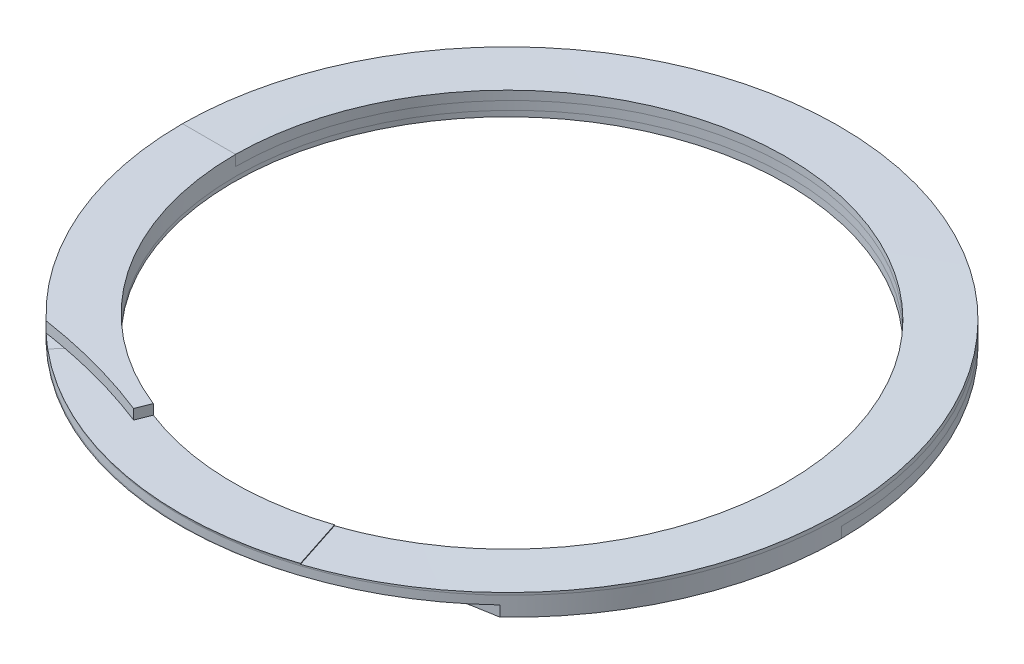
ISO-10303-21;
HEADER;
FILE_DESCRIPTION(('STEP AP214'),'2;1');
FILE_NAME('part.step','',(''),(''),'','','');
FILE_SCHEMA(('AUTOMOTIVE_DESIGN { 1 0 10303 214 1 1 1 1 }'));
ENDSEC;
DATA;
#1=APPLICATION_CONTEXT('core data for automotive mechanical design processes');
#2=APPLICATION_PROTOCOL_DEFINITION('international standard','automotive_design',2000,#1);
#3=PRODUCT_CONTEXT('',#1,'mechanical');
#4=PRODUCT('Part','Part','',(#3));
#5=PRODUCT_RELATED_PRODUCT_CATEGORY('part','',(#4));
#6=PRODUCT_DEFINITION_FORMATION('','',#4);
#7=PRODUCT_DEFINITION_CONTEXT('part definition',#1,'design');
#8=PRODUCT_DEFINITION('design','',#6,#7);
#9=PRODUCT_DEFINITION_SHAPE('','',#8);
#10=(LENGTH_UNIT() NAMED_UNIT(*) SI_UNIT(.MILLI.,.METRE.));
#11=(NAMED_UNIT(*) PLANE_ANGLE_UNIT() SI_UNIT($,.RADIAN.));
#12=(NAMED_UNIT(*) SI_UNIT($,.STERADIAN.) SOLID_ANGLE_UNIT());
#13=UNCERTAINTY_MEASURE_WITH_UNIT(LENGTH_MEASURE(1.E-05),#10,'distance_accuracy_value','');
#14=(GEOMETRIC_REPRESENTATION_CONTEXT(3) GLOBAL_UNCERTAINTY_ASSIGNED_CONTEXT((#13)) GLOBAL_UNIT_ASSIGNED_CONTEXT((#10,
#11,#12)) REPRESENTATION_CONTEXT('',''));
#15=CARTESIAN_POINT('',(0.,0.,0.));
#16=DIRECTION('',(0.,0.,1.));
#17=DIRECTION('',(1.,0.,0.));
#18=AXIS2_PLACEMENT_3D('',#15,#16,#17);
#19=CARTESIAN_POINT('',(0.,-1.0668,0.));
#20=DIRECTION('',(0.,1.,0.));
#21=DIRECTION('',(0.,0.,1.));
#22=AXIS2_PLACEMENT_3D('',#19,#20,#21);
#23=CYLINDRICAL_SURFACE('',#22,9.9187);
#24=CARTESIAN_POINT('',(0.,-0.6858,0.));
#25=DIRECTION('',(0.,1.,0.));
#26=DIRECTION('',(0.,0.,1.));
#27=AXIS2_PLACEMENT_3D('',#24,#25,#26);
#28=CIRCLE('',#27,9.9187);
#29=CARTESIAN_POINT('',(3.06504244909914,-0.685442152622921,9.43324570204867));
#30=VERTEX_POINT('',#29);
#31=CARTESIAN_POINT('',(3.64850153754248,-0.6858,9.22328825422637));
#32=VERTEX_POINT('',#31);
#33=EDGE_CURVE('E208',#30,#32,#28,.T.);
#34=ORIENTED_EDGE('',*,*,#33,.F.);
#35=CARTESIAN_POINT('',(9.9187,-1.0668,0.));
#36=CARTESIAN_POINT('',(9.9187,-1.0271125,-5.72656411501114));
#37=CARTESIAN_POINT('',(4.95935,-0.987425,-8.58984617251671));
#38=CARTESIAN_POINT('',(0.,-0.9477375,-11.4531282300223));
#39=CARTESIAN_POINT('',(-4.95935,-0.90805,-8.58984617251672));
#40=CARTESIAN_POINT('',(-9.9187,-0.8683625,-5.72656411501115));
#41=CARTESIAN_POINT('',(-9.9187,-0.828675,0.));
#42=CARTESIAN_POINT('',(-9.9187,-0.7889875,5.72656411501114));
#43=CARTESIAN_POINT('',(-4.95935000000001,-0.7493,8.58984617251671));
#44=CARTESIAN_POINT('',(-1.13490607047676,-0.718694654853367,10.7978899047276));
#45=CARTESIAN_POINT('',(3.06504321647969,-0.685084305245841,9.43324545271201));
#46=CARTESIAN_POINT('',(3.3015381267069,-0.683191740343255,9.35640369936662));
#47=CARTESIAN_POINT('',(3.53803303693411,-0.681299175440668,9.27956194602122));
#48=(BOUNDED_CURVE() B_SPLINE_CURVE(2,(#35,#36,#37,#38,#39,#40,#41,#42,#43,#44,#45,#46,#47),
.UNSPECIFIED.,.F.,.F.) B_SPLINE_CURVE_WITH_KNOTS((3,2,2,2,2,2,3),(0.,0.166666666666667,
0.333333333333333,0.5,0.666666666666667,0.799258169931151,0.807250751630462),
.UNSPECIFIED.) CURVE() GEOMETRIC_REPRESENTATION_ITEM() RATIONAL_B_SPLINE_CURVE((1.,
0.866025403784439,1.,0.866025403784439,1.,0.866025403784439,1.,0.866025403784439,1.,
0.893416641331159,0.95641785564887,0.95641785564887,0.95641785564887)) REPRESENTATION_ITEM(''));
#49=CARTESIAN_POINT('',(2.97561000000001,-0.6858,9.46183675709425));
#50=VERTEX_POINT('',#49);
#51=EDGE_CURVE('E290',#50,#30,#48,.T.);
#52=ORIENTED_EDGE('',*,*,#51,.F.);
#53=CARTESIAN_POINT('',(9.9187,-0.6858,0.));
#54=VERTEX_POINT('',#53);
#55=EDGE_CURVE('E53',#54,#50,#28,.T.);
#56=ORIENTED_EDGE('',*,*,#55,.F.);
#57=DIRECTION('',(0.,-1.,0.));
#58=VECTOR('',#57,1.);
#59=CARTESIAN_POINT('',(9.9187,-0.6858,0.));
#60=LINE('',#59,#58);
#61=CARTESIAN_POINT('',(9.9187,-1.0668,0.));
#62=VERTEX_POINT('',#61);
#63=EDGE_CURVE('E178',#54,#62,#60,.T.);
#64=ORIENTED_EDGE('',*,*,#63,.T.);
#65=CARTESIAN_POINT('',(0.,-1.0668,0.));
#66=DIRECTION('',(0.,1.,0.));
#67=DIRECTION('',(0.,0.,1.));
#68=AXIS2_PLACEMENT_3D('',#65,#66,#67);
#69=CIRCLE('',#68,9.9187);
#70=CARTESIAN_POINT('',(3.64850153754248,-1.0668,9.22328825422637));
#71=VERTEX_POINT('',#70);
#72=EDGE_CURVE('E507',#71,#62,#69,.T.);
#73=ORIENTED_EDGE('',*,*,#72,.F.);
#74=DIRECTION('',(0.,-1.,0.));
#75=VECTOR('',#74,1.);
#76=CARTESIAN_POINT('',(3.64850153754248,-0.6858,9.22328825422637));
#77=LINE('',#76,#75);
#78=EDGE_CURVE('E186',#32,#71,#77,.T.);
#79=ORIENTED_EDGE('',*,*,#78,.F.);
#80=EDGE_LOOP('',(#34,#52,#56,#64,#73,#79));
#81=FACE_BOUND('',#80,.T.);
#82=CARTESIAN_POINT('',(3.53803152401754,-0.328874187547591,9.2795625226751));
#83=CARTESIAN_POINT('',(3.30153660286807,-0.330766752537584,9.35640423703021));
#84=CARTESIAN_POINT('',(3.06504168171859,-0.332659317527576,9.43324595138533));
#85=CARTESIAN_POINT('',(-1.13490690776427,-0.366269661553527,10.7978894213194));
#86=CARTESIAN_POINT('',(-4.95935000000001,-0.396874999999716,8.58984617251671));
#87=CARTESIAN_POINT('',(-9.9187,-0.436562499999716,5.72656411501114));
#88=CARTESIAN_POINT('',(-9.9187,-0.476249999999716,0.));
#89=CARTESIAN_POINT('',(-9.9187,-0.515937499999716,-5.72656411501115));
#90=CARTESIAN_POINT('',(-4.95935,-0.555624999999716,-8.58984617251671));
#91=CARTESIAN_POINT('',(0.,-0.595312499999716,-11.4531282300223));
#92=CARTESIAN_POINT('',(4.95935,-0.634999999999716,-8.58984617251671));
#93=CARTESIAN_POINT('',(9.9187,-0.674687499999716,-5.72656411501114));
#94=CARTESIAN_POINT('',(9.9187,-0.714374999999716,0.));
#95=(BOUNDED_CURVE() B_SPLINE_CURVE(2,(#82,#83,#84,#85,#86,#87,#88,#89,#90,#91,#92,#93,#94),
.UNSPECIFIED.,.F.,.F.) B_SPLINE_CURVE_WITH_KNOTS((3,2,2,2,2,2,3),(0.,0.00799258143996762,
0.140584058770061,0.307250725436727,0.473917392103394,0.640584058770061,0.807250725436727),
.UNSPECIFIED.) CURVE() GEOMETRIC_REPRESENTATION_ITEM() RATIONAL_B_SPLINE_CURVE((0.956417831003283,
0.956417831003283,0.956417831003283,0.893416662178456,1.,0.866025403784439,1.,0.866025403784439,
1.,0.866025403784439,1.,0.866025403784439,1.)) REPRESENTATION_ITEM(''));
#96=CARTESIAN_POINT('',(-2.97561,-0.381,9.46183675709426));
#97=VERTEX_POINT('',#96);
#98=CARTESIAN_POINT('',(-3.06504321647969,-0.381536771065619,9.43324545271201));
#99=VERTEX_POINT('',#98);
#100=EDGE_CURVE('E218',#97,#99,#95,.T.);
#101=ORIENTED_EDGE('',*,*,#100,.F.);
#102=CARTESIAN_POINT('',(0.,-0.381,0.));
#103=DIRECTION('',(0.,-1.,0.));
#104=DIRECTION('',(0.,0.,1.));
#105=AXIS2_PLACEMENT_3D('',#102,#103,#104);
#106=CIRCLE('',#105,9.9187);
#107=CARTESIAN_POINT('',(-9.9187,-0.381,0.));
#108=VERTEX_POINT('',#107);
#109=EDGE_CURVE('E249',#108,#97,#106,.T.);
#110=ORIENTED_EDGE('',*,*,#109,.F.);
#111=DIRECTION('',(0.,1.,0.));
#112=VECTOR('',#111,1.);
#113=CARTESIAN_POINT('',(-9.9187,-0.381,0.));
#114=LINE('',#113,#112);
#115=CARTESIAN_POINT('',(-9.9187,0.,0.));
#116=VERTEX_POINT('',#115);
#117=EDGE_CURVE('E512',#108,#116,#114,.T.);
#118=ORIENTED_EDGE('',*,*,#117,.T.);
#119=CARTESIAN_POINT('',(0.,0.,0.));
#120=DIRECTION('',(0.,1.,0.));
#121=DIRECTION('',(0.,0.,1.));
#122=AXIS2_PLACEMENT_3D('',#119,#120,#121);
#123=CIRCLE('',#122,9.9187);
#124=CARTESIAN_POINT('',(-3.64850153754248,0.,9.22328825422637));
#125=VERTEX_POINT('',#124);
#126=EDGE_CURVE('E508',#116,#125,#123,.T.);
#127=ORIENTED_EDGE('',*,*,#126,.T.);
#128=DIRECTION('',(0.,1.,0.));
#129=VECTOR('',#128,1.);
#130=CARTESIAN_POINT('',(-3.64850153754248,-0.381,9.22328825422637));
#131=LINE('',#130,#129);
#132=CARTESIAN_POINT('',(-3.64850153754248,-0.357809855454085,9.22328825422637));
#133=VERTEX_POINT('',#132);
#134=EDGE_CURVE('E518',#133,#125,#131,.T.);
#135=ORIENTED_EDGE('',*,*,#134,.F.);
#136=CARTESIAN_POINT('',(-3.64850153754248,-0.381,9.22328825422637));
#137=VERTEX_POINT('',#136);
#138=EDGE_CURVE('E515',#137,#133,#131,.T.);
#139=ORIENTED_EDGE('',*,*,#138,.F.);
#140=EDGE_CURVE('E245',#99,#137,#106,.T.);
#141=ORIENTED_EDGE('',*,*,#140,.F.);
#142=EDGE_LOOP('',(#101,#110,#118,#127,#135,#139,#141));
#143=FACE_BOUND('',#142,.T.);
#144=ADVANCED_FACE('F48',(#81,#143),#23,.F.);
#145=CARTESIAN_POINT('',(0.,-1.0668,0.));
#146=DIRECTION('',(0.,1.,0.));
#147=DIRECTION('',(0.,0.,1.));
#148=AXIS2_PLACEMENT_3D('',#145,#146,#147);
#149=CYLINDRICAL_SURFACE('',#148,11.8237);
#150=DIRECTION('',(0.,1.,0.));
#151=VECTOR('',#150,1.);
#152=CARTESIAN_POINT('',(-11.8237,-0.381,0.));
#153=LINE('',#152,#151);
#154=CARTESIAN_POINT('',(-11.8237,-0.381,0.));
#155=VERTEX_POINT('',#154);
#156=CARTESIAN_POINT('',(-11.8237,0.,0.));
#157=VERTEX_POINT('',#156);
#158=EDGE_CURVE('E523',#155,#157,#153,.T.);
#159=ORIENTED_EDGE('',*,*,#158,.F.);
#160=CARTESIAN_POINT('',(0.,-0.381,0.));
#161=DIRECTION('',(0.,1.,0.));
#162=DIRECTION('',(0.,0.,1.));
#163=AXIS2_PLACEMENT_3D('',#160,#161,#162);
#164=CIRCLE('',#163,11.8237);
#165=CARTESIAN_POINT('',(-3.54710999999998,-0.381,11.2790909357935));
#166=VERTEX_POINT('',#165);
#167=EDGE_CURVE('E534',#166,#155,#164,.T.);
#168=ORIENTED_EDGE('',*,*,#167,.F.);
#169=CARTESIAN_POINT('',(11.8237,-0.714374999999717,0.));
#170=CARTESIAN_POINT('',(11.8237,-0.674687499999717,-6.82641637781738));
#171=CARTESIAN_POINT('',(5.91185,-0.634999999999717,-10.2396245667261));
#172=CARTESIAN_POINT('',(0.,-0.595312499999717,-13.6528327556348));
#173=CARTESIAN_POINT('',(-5.91185,-0.555624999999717,-10.2396245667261));
#174=CARTESIAN_POINT('',(-11.8237,-0.515937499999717,-6.82641637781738));
#175=CARTESIAN_POINT('',(-11.8237,-0.476249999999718,0.));
#176=CARTESIAN_POINT('',(-11.8237,-0.436562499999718,6.82641637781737));
#177=CARTESIAN_POINT('',(-5.91185,-0.396874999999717,10.2396245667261));
#178=CARTESIAN_POINT('',(-1.35287541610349,-0.366269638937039,12.8717497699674));
#179=CARTESIAN_POINT('',(3.65372423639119,-0.332659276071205,11.245006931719));
#180=(BOUNDED_CURVE() B_SPLINE_CURVE(2,(#169,#170,#171,#172,#173,#174,#175,#176,#177,#178,#179),
.UNSPECIFIED.,.F.,.F.) B_SPLINE_CURVE_WITH_KNOTS((3,2,2,2,2,3),(0.,0.166666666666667,
0.333333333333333,0.5,0.666666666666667,0.799258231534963),
.UNSPECIFIED.) CURVE() GEOMETRIC_REPRESENTATION_ITEM() RATIONAL_B_SPLINE_CURVE((1.,
0.866025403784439,1.,0.866025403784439,1.,0.866025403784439,1.,0.866025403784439,1.,
0.893416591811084,0.956417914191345)) REPRESENTATION_ITEM(''));
#181=CARTESIAN_POINT('',(-3.65372097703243,-0.381536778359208,11.2450079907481));
#182=VERTEX_POINT('',#181);
#183=EDGE_CURVE('E210',#166,#182,#180,.F.);
#184=ORIENTED_EDGE('',*,*,#183,.T.);
#185=CARTESIAN_POINT('',(-7.61957439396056,-0.381,9.04112646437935));
#186=CARTESIAN_POINT('',(-7.52244205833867,-0.381,9.12298327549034));
#187=CARTESIAN_POINT('',(-7.42401218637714,-0.381,9.20326173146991));
#188=CARTESIAN_POINT('',(-7.22449138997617,-0.381,9.36070524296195));
#189=CARTESIAN_POINT('',(-7.12339726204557,-0.381,9.4378662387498));
#190=CARTESIAN_POINT('',(-6.6078727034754,-0.381,9.81831997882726));
#191=CARTESIAN_POINT('',(-6.17445648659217,-0.381,10.0965387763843));
#192=CARTESIAN_POINT('',(-5.27510149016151,-0.381,10.5942115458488));
#193=CARTESIAN_POINT('',(-4.80916241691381,-0.381,10.8136649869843));
#194=CARTESIAN_POINT('',(-4.21147242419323,-0.381,11.0489830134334));
#195=CARTESIAN_POINT('',(-4.09086527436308,-0.381,11.0942019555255));
#196=CARTESIAN_POINT('',(-3.84839283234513,-0.381,11.1806203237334));
#197=CARTESIAN_POINT('',(-3.72652934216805,-0.381,11.2218248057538));
#198=CARTESIAN_POINT('',(-3.60400278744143,-0.381,11.2610410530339));
#199=B_SPLINE_CURVE_WITH_KNOTS('',3,(#185,#186,#187,#188,#189,#190,#191,#192,#193,#194,#195,
#196,#197,#198),.UNSPECIFIED.,.F.,.F.,(4,2,2,2,2,2,4),(0.,0.381007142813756,0.762495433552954,
2.30280226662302,3.84312301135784,4.22949625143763,4.61537641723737),.UNSPECIFIED.);
#200=CARTESIAN_POINT('',(-7.61957439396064,-0.381000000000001,9.04112646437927));
#201=VERTEX_POINT('',#200);
#202=EDGE_CURVE('E363',#201,#182,#199,.T.);
#203=ORIENTED_EDGE('',*,*,#202,.F.);
#204=CARTESIAN_POINT('',(-8.14281502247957,-0.381,8.57289013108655));
#205=VERTEX_POINT('',#204);
#206=EDGE_CURVE('E536',#205,#201,#164,.T.);
#207=ORIENTED_EDGE('',*,*,#206,.F.);
#208=DIRECTION('',(0.,1.,0.));
#209=VECTOR('',#208,1.);
#210=CARTESIAN_POINT('',(-8.14281502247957,-0.381,8.57289013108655));
#211=LINE('',#210,#209);
#212=CARTESIAN_POINT('',(-8.14281502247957,0.,8.57289013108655));
#213=VERTEX_POINT('',#212);
#214=EDGE_CURVE('E520',#205,#213,#211,.T.);
#215=ORIENTED_EDGE('',*,*,#214,.T.);
#216=CARTESIAN_POINT('',(0.,0.,0.));
#217=DIRECTION('',(0.,1.,0.));
#218=DIRECTION('',(0.,0.,1.));
#219=AXIS2_PLACEMENT_3D('',#216,#217,#218);
#220=CIRCLE('',#219,11.8237);
#221=EDGE_CURVE('E59',#157,#213,#220,.T.);
#222=ORIENTED_EDGE('',*,*,#221,.F.);
#223=EDGE_LOOP('',(#159,#168,#184,#203,#207,#215,#222));
#224=FACE_BOUND('',#223,.T.);
#225=CARTESIAN_POINT('',(4.21755282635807,-0.681299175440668,11.0618081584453));
#226=CARTESIAN_POINT('',(3.93563635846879,-0.683191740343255,11.1534082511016));
#227=CARTESIAN_POINT('',(3.65371989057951,-0.685084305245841,11.2450083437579));
#228=CARTESIAN_POINT('',(-1.35287778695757,-0.718694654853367,12.8717484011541));
#229=CARTESIAN_POINT('',(-5.91185,-0.7493,10.2396245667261));
#230=CARTESIAN_POINT('',(-11.8237,-0.7889875,6.82641637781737));
#231=CARTESIAN_POINT('',(-11.8237,-0.828675,0.));
#232=CARTESIAN_POINT('',(-11.8237,-0.8683625,-6.82641637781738));
#233=CARTESIAN_POINT('',(-5.91185,-0.90805,-10.2396245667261));
#234=CARTESIAN_POINT('',(0.,-0.9477375,-13.6528327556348));
#235=CARTESIAN_POINT('',(5.91185,-0.987425,-10.2396245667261));
#236=CARTESIAN_POINT('',(11.8237,-1.0271125,-6.82641637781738));
#237=CARTESIAN_POINT('',(11.8237,-1.0668,0.));
#238=(BOUNDED_CURVE() B_SPLINE_CURVE(2,(#225,#226,#227,#228,#229,#230,#231,#232,#233,#234,#235,
#236,#237),.UNSPECIFIED.,.F.,.F.) B_SPLINE_CURVE_WITH_KNOTS((3,2,2,2,2,2,3),(0.,
0.0079925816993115,0.140584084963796,0.307250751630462,0.473917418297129,0.640584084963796,
0.807250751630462),
.UNSPECIFIED.) CURVE() GEOMETRIC_REPRESENTATION_ITEM() RATIONAL_B_SPLINE_CURVE((0.95641785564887,
0.95641785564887,0.95641785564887,0.893416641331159,1.,0.866025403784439,1.,0.866025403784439,
1.,0.866025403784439,1.,0.866025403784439,1.)) REPRESENTATION_ITEM(''));
#239=CARTESIAN_POINT('',(3.54711000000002,-0.6858,11.2790909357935));
#240=VERTEX_POINT('',#239);
#241=CARTESIAN_POINT('',(3.65372423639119,-0.685442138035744,11.245006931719));
#242=VERTEX_POINT('',#241);
#243=EDGE_CURVE('E71',#240,#242,#238,.F.);
#244=ORIENTED_EDGE('',*,*,#243,.T.);
#245=CARTESIAN_POINT('',(0.,-0.6858,0.));
#246=DIRECTION('',(0.,-1.,0.));
#247=DIRECTION('',(0.,0.,1.));
#248=AXIS2_PLACEMENT_3D('',#245,#246,#247);
#249=CIRCLE('',#248,11.8237);
#250=CARTESIAN_POINT('',(8.14281502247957,-0.6858,8.57289013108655));
#251=VERTEX_POINT('',#250);
#252=EDGE_CURVE('E183',#251,#242,#249,.T.);
#253=ORIENTED_EDGE('',*,*,#252,.F.);
#254=DIRECTION('',(0.,-1.,0.));
#255=VECTOR('',#254,1.);
#256=CARTESIAN_POINT('',(8.14281502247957,-0.6858,8.57289013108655));
#257=LINE('',#256,#255);
#258=CARTESIAN_POINT('',(8.14281502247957,-1.0668,8.57289013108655));
#259=VERTEX_POINT('',#258);
#260=EDGE_CURVE('E179',#251,#259,#257,.T.);
#261=ORIENTED_EDGE('',*,*,#260,.T.);
#262=CARTESIAN_POINT('',(0.,-1.0668,0.));
#263=DIRECTION('',(0.,1.,0.));
#264=DIRECTION('',(0.,0.,1.));
#265=AXIS2_PLACEMENT_3D('',#262,#263,#264);
#266=CIRCLE('',#265,11.8237);
#267=CARTESIAN_POINT('',(11.8237,-1.0668,0.));
#268=VERTEX_POINT('',#267);
#269=EDGE_CURVE('E12',#259,#268,#266,.T.);
#270=ORIENTED_EDGE('',*,*,#269,.T.);
#271=DIRECTION('',(0.,-1.,0.));
#272=VECTOR('',#271,1.);
#273=CARTESIAN_POINT('',(11.8237,-0.6858,0.));
#274=LINE('',#273,#272);
#275=CARTESIAN_POINT('',(11.8237,-0.6858,0.));
#276=VERTEX_POINT('',#275);
#277=EDGE_CURVE('E172',#276,#268,#274,.T.);
#278=ORIENTED_EDGE('',*,*,#277,.F.);
#279=EDGE_CURVE('E67',#240,#276,#249,.T.);
#280=ORIENTED_EDGE('',*,*,#279,.F.);
#281=EDGE_LOOP('',(#244,#253,#261,#270,#278,#280));
#282=FACE_BOUND('',#281,.T.);
#283=ADVANCED_FACE('F50',(#224,#282),#149,.T.);
#284=CARTESIAN_POINT('',(0.,-1.0668,0.));
#285=DIRECTION('',(0.,1.,0.));
#286=DIRECTION('',(0.,0.,1.));
#287=AXIS2_PLACEMENT_3D('',#284,#285,#286);
#288=PLANE('',#287);
#289=ORIENTED_EDGE('',*,*,#72,.T.);
#290=DIRECTION('',(-1.,0.,0.));
#291=VECTOR('',#290,1.);
#292=CARTESIAN_POINT('',(9.9187,-1.0668,0.));
#293=LINE('',#292,#291);
#294=EDGE_CURVE('E205',#268,#62,#293,.T.);
#295=ORIENTED_EDGE('',*,*,#294,.F.);
#296=ORIENTED_EDGE('',*,*,#269,.F.);
#297=CARTESIAN_POINT('',(11.0496687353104,-1.0668,27.9331881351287));
#298=DIRECTION('',(0.,-1.,0.));
#299=DIRECTION('',(0.,0.,1.));
#300=AXIS2_PLACEMENT_3D('',#297,#298,#299);
#301=CIRCLE('',#300,19.5773066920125);
#302=CARTESIAN_POINT('',(3.8483385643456,-1.0668,9.72846948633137));
#303=VERTEX_POINT('',#302);
#304=EDGE_CURVE('E202',#303,#259,#301,.T.);
#305=ORIENTED_EDGE('',*,*,#304,.F.);
#306=DIRECTION('',(0.367840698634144,0.,0.929888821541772));
#307=VECTOR('',#306,1.);
#308=CARTESIAN_POINT('',(3.84833856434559,-1.0668,9.72846948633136));
#309=LINE('',#308,#307);
#310=EDGE_CURVE('E198',#71,#303,#309,.T.);
#311=ORIENTED_EDGE('',*,*,#310,.F.);
#312=EDGE_LOOP('',(#289,#295,#296,#305,#311));
#313=FACE_BOUND('',#312,.T.);
#314=ADVANCED_FACE('F467',(#313),#288,.F.);
#315=CARTESIAN_POINT('',(0.,0.,0.));
#316=DIRECTION('',(0.,1.,0.));
#317=DIRECTION('',(0.,0.,1.));
#318=AXIS2_PLACEMENT_3D('',#315,#316,#317);
#319=PLANE('',#318);
#320=DIRECTION('',(1.,0.,0.));
#321=VECTOR('',#320,1.);
#322=CARTESIAN_POINT('',(-9.9187,0.,0.));
#323=LINE('',#322,#321);
#324=EDGE_CURVE('E525',#157,#116,#323,.T.);
#325=ORIENTED_EDGE('',*,*,#324,.F.);
#326=ORIENTED_EDGE('',*,*,#221,.T.);
#327=CARTESIAN_POINT('',(-11.0496687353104,0.,27.9331881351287));
#328=DIRECTION('',(0.,1.,0.));
#329=DIRECTION('',(0.,0.,1.));
#330=AXIS2_PLACEMENT_3D('',#327,#328,#329);
#331=CIRCLE('',#330,19.5773066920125);
#332=CARTESIAN_POINT('',(-3.8483385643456,0.,9.72846948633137));
#333=VERTEX_POINT('',#332);
#334=EDGE_CURVE('E528',#333,#213,#331,.T.);
#335=ORIENTED_EDGE('',*,*,#334,.F.);
#336=DIRECTION('',(-0.367840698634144,0.,0.929888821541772));
#337=VECTOR('',#336,1.);
#338=CARTESIAN_POINT('',(-3.84833856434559,0.,9.72846948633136));
#339=LINE('',#338,#337);
#340=EDGE_CURVE('E230',#125,#333,#339,.T.);
#341=ORIENTED_EDGE('',*,*,#340,.F.);
#342=ORIENTED_EDGE('',*,*,#126,.F.);
#343=EDGE_LOOP('',(#325,#326,#335,#341,#342));
#344=FACE_BOUND('',#343,.T.);
#345=ADVANCED_FACE('F629',(#344),#319,.T.);
#346=CARTESIAN_POINT('',(-11.0496687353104,-0.381,27.9331881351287));
#347=DIRECTION('',(0.,1.,0.));
#348=DIRECTION('',(0.,0.,1.));
#349=AXIS2_PLACEMENT_3D('',#346,#347,#348);
#350=CYLINDRICAL_SURFACE('',#349,19.5773066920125);
#351=CARTESIAN_POINT('',(-11.0496687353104,-0.381,27.9331881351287));
#352=DIRECTION('',(0.,1.,0.));
#353=DIRECTION('',(0.,0.,1.));
#354=AXIS2_PLACEMENT_3D('',#351,#352,#353);
#355=CIRCLE('',#354,19.5773066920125);
#356=CARTESIAN_POINT('',(-7.34084849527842,-0.381,8.71039984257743));
#357=VERTEX_POINT('',#356);
#358=EDGE_CURVE('E241',#357,#205,#355,.T.);
#359=ORIENTED_EDGE('',*,*,#358,.F.);
#360=CARTESIAN_POINT('',(-7.34084849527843,-0.381,8.71039984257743));
#361=CARTESIAN_POINT('',(-7.22136199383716,-0.380303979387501,8.73345327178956));
#362=CARTESIAN_POINT('',(-7.10209056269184,-0.379596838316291,8.75762102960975));
#363=CARTESIAN_POINT('',(-6.8641837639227,-0.378164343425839,8.80814123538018));
#364=CARTESIAN_POINT('',(-6.74554774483,-0.377439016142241,8.83449061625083));
#365=CARTESIAN_POINT('',(-6.50890972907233,-0.375972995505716,8.88936545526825));
#366=CARTESIAN_POINT('',(-6.390907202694,-0.375232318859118,8.91788862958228));
#367=CARTESIAN_POINT('',(-6.15553460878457,-0.373739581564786,8.9771045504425));
#368=CARTESIAN_POINT('',(-6.0381641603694,-0.372987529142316,9.00779578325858));
#369=CARTESIAN_POINT('',(-5.80405470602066,-0.371474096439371,9.07134365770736));
#370=CARTESIAN_POINT('',(-5.68731549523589,-0.370712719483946,9.10419954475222));
#371=CARTESIAN_POINT('',(-5.45446774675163,-0.369191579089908,9.1720749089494));
#372=CARTESIAN_POINT('',(-5.33835920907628,-0.368431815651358,9.20709438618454));
#373=CARTESIAN_POINT('',(-5.10677291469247,-0.366886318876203,9.2792973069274));
#374=CARTESIAN_POINT('',(-4.99129539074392,-0.366100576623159,9.31648149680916));
#375=CARTESIAN_POINT('',(-4.76097199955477,-0.364502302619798,9.39301641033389));
#376=CARTESIAN_POINT('',(-4.64612662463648,-0.36368975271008,9.43236861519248));
#377=CARTESIAN_POINT('',(-4.41706912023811,-0.362042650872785,9.51324441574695));
#378=CARTESIAN_POINT('',(-4.30285777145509,-0.361208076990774,9.55477022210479));
#379=CARTESIAN_POINT('',(-4.07507057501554,-0.359521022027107,9.6400001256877));
#380=CARTESIAN_POINT('',(-3.96149582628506,-0.358668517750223,9.68370715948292));
#381=CARTESIAN_POINT('',(-3.84833856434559,-0.357809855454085,9.72846948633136));
#382=B_SPLINE_CURVE_WITH_KNOTS('',3,(#360,#361,#362,#363,#364,#365,#366,#367,#368,#369,#370,
#371,#372,#373,#374,#375,#376,#377,#378,#379,#380,#381),.UNSPECIFIED.,.F.,.F.,(4,2,2,2,2,2,2,2,
2,2,4),(0.,0.365071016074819,0.729637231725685,1.09382557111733,1.45776210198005,
1.82157243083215,2.18538277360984,2.54931930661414,2.91350764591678,3.27807386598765,
3.6431448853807),.UNSPECIFIED.);
#383=CARTESIAN_POINT('',(-3.8483385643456,-0.357809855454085,9.72846948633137));
#384=VERTEX_POINT('',#383);
#385=EDGE_CURVE('E450',#357,#384,#382,.T.);
#386=ORIENTED_EDGE('',*,*,#385,.T.);
#387=DIRECTION('',(0.,1.,0.));
#388=VECTOR('',#387,1.);
#389=CARTESIAN_POINT('',(-3.8483385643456,-0.381,9.72846948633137));
#390=LINE('',#389,#388);
#391=EDGE_CURVE('E517',#384,#333,#390,.T.);
#392=ORIENTED_EDGE('',*,*,#391,.T.);
#393=ORIENTED_EDGE('',*,*,#334,.T.);
#394=ORIENTED_EDGE('',*,*,#214,.F.);
#395=EDGE_LOOP('',(#359,#386,#392,#393,#394));
#396=FACE_BOUND('',#395,.T.);
#397=ADVANCED_FACE('F436',(#396),#350,.F.);
#398=CARTESIAN_POINT('',(-3.84833856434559,-0.381,9.72846948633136));
#399=DIRECTION('',(-0.929888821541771,0.,-0.367840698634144));
#400=DIRECTION('',(-0.367840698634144,0.,0.929888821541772));
#401=AXIS2_PLACEMENT_3D('',#398,#399,#400);
#402=PLANE('',#401);
#403=ORIENTED_EDGE('',*,*,#391,.F.);
#404=CARTESIAN_POINT('',(-3.84833856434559,-0.357809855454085,9.72846948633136));
#405=CARTESIAN_POINT('',(-3.78172622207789,-0.357809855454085,9.56007574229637));
#406=CARTESIAN_POINT('',(-3.71511387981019,-0.357809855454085,9.39168199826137));
#407=CARTESIAN_POINT('',(-3.64850153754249,-0.357809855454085,9.22328825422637));
#408=B_SPLINE_CURVE_WITH_KNOTS('',3,(#404,#405,#406,#407),.UNSPECIFIED.,.F.,.F.,(4,4),(0.,
0.543270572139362),.UNSPECIFIED.);
#409=EDGE_CURVE('E364',#384,#133,#408,.T.);
#410=ORIENTED_EDGE('',*,*,#409,.T.);
#411=ORIENTED_EDGE('',*,*,#134,.T.);
#412=ORIENTED_EDGE('',*,*,#340,.T.);
#413=EDGE_LOOP('',(#403,#410,#411,#412));
#414=FACE_BOUND('',#413,.T.);
#415=ADVANCED_FACE('F432',(#414),#402,.F.);
#416=CARTESIAN_POINT('',(0.,-0.381,0.));
#417=DIRECTION('',(0.,1.,0.));
#418=DIRECTION('',(0.,0.,1.));
#419=AXIS2_PLACEMENT_3D('',#416,#417,#418);
#420=PLANE('',#419);
#421=CARTESIAN_POINT('',(-7.21144781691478,-0.381,8.55685742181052));
#422=CARTESIAN_POINT('',(-7.34749000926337,-0.381,8.71828043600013));
#423=CARTESIAN_POINT('',(-7.48353220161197,-0.381,8.87970345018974));
#424=CARTESIAN_POINT('',(-7.61957439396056,-0.381,9.04112646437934));
#425=B_SPLINE_CURVE_WITH_KNOTS('',3,(#421,#422,#423,#424),.UNSPECIFIED.,.F.,.F.,(4,4),(0.,
0.633311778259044),.UNSPECIFIED.);
#426=EDGE_CURVE('E448',#357,#201,#425,.T.);
#427=ORIENTED_EDGE('',*,*,#426,.F.);
#428=ORIENTED_EDGE('',*,*,#358,.T.);
#429=ORIENTED_EDGE('',*,*,#206,.T.);
#430=EDGE_LOOP('',(#427,#428,#429));
#431=FACE_BOUND('',#430,.T.);
#432=ADVANCED_FACE('F427',(#431),#420,.T.);
#433=CARTESIAN_POINT('',(-9.9187,0.,0.));
#434=CARTESIAN_POINT('',(-9.9187,-0.0396875,-5.72656411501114));
#435=CARTESIAN_POINT('',(-4.95935,-0.079375,-8.58984617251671));
#436=CARTESIAN_POINT('',(0.,-0.1190625,-11.4531282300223));
#437=CARTESIAN_POINT('',(4.95935,-0.15875,-8.58984617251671));
#438=CARTESIAN_POINT('',(9.9187,-0.1984375,-5.72656411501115));
#439=CARTESIAN_POINT('',(9.9187,-0.238125,0.));
#440=CARTESIAN_POINT('',(9.9187,-0.2778125,5.72656411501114));
#441=CARTESIAN_POINT('',(4.95935000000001,-0.3175,8.58984617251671));
#442=CARTESIAN_POINT('',(1.13490690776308,-0.348105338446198,10.7978894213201));
#443=CARTESIAN_POINT('',(-3.06504168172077,-0.381715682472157,9.43324595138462));
#444=CARTESIAN_POINT('',(-3.30153660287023,-0.38360824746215,9.35640423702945));
#445=CARTESIAN_POINT('',(-3.53803152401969,-0.385500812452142,9.27956252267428));
#446=CARTESIAN_POINT('',(-9.9187,-0.381,0.));
#447=CARTESIAN_POINT('',(-9.9187,-0.4206875,-5.72656411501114));
#448=CARTESIAN_POINT('',(-4.95935,-0.460375,-8.58984617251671));
#449=CARTESIAN_POINT('',(0.,-0.5000625,-11.4531282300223));
#450=CARTESIAN_POINT('',(4.95935,-0.53975,-8.58984617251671));
#451=CARTESIAN_POINT('',(9.9187,-0.5794375,-5.72656411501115));
#452=CARTESIAN_POINT('',(9.9187,-0.619125,0.));
#453=CARTESIAN_POINT('',(9.9187,-0.6588125,5.72656411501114));
#454=CARTESIAN_POINT('',(4.95935000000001,-0.6985,8.58984617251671));
#455=CARTESIAN_POINT('',(1.13490690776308,-0.729105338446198,10.7978894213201));
#456=CARTESIAN_POINT('',(-3.06504168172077,-0.762715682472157,9.43324595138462));
#457=CARTESIAN_POINT('',(-3.30153660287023,-0.76460824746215,9.35640423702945));
#458=CARTESIAN_POINT('',(-3.53803152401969,-0.766500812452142,9.27956252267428));
#459=(BOUNDED_SURFACE() B_SPLINE_SURFACE(1,2,((#433,#434,#435,#436,#437,#438,#439,#440,#441,
#442,#443,#444,#445),(#446,#447,#448,#449,#450,#451,#452,#453,#454,#455,#456,#457,#458)),
.UNSPECIFIED.,.F.,.F.,.F.) B_SPLINE_SURFACE_WITH_KNOTS((2,2),(3,2,2,2,2,2,3),(0.,1.),(0.,
0.166666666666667,0.333333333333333,0.5,0.666666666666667,0.799258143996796,0.807250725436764),
.UNSPECIFIED.) GEOMETRIC_REPRESENTATION_ITEM() RATIONAL_B_SPLINE_SURFACE(((1.,0.866025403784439,
1.,0.866025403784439,1.,0.866025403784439,1.,0.866025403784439,1.,0.893416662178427,
0.956417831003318,0.956417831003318,0.956417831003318),(1.,0.866025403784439,1.,
0.866025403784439,1.,0.866025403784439,1.,0.866025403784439,1.,0.893416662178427,
0.956417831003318,0.956417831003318,0.956417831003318))) REPRESENTATION_ITEM('') SURFACE());
#460=CARTESIAN_POINT('',(3.06504168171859,-0.33265931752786,9.43324595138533));
#461=CARTESIAN_POINT('',(2.94415686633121,-0.333626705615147,9.47252357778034));
#462=CARTESIAN_POINT('',(2.82252947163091,-0.334600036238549,9.50947345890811));
#463=CARTESIAN_POINT('',(2.57789769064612,-0.336557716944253,9.57868583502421));
#464=CARTESIAN_POINT('',(2.45489279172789,-0.337542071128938,9.61094651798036));
#465=CARTESIAN_POINT('',(2.08350259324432,-0.340514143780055,9.70075220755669));
#466=CARTESIAN_POINT('',(1.83334252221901,-0.342516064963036,9.75112564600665));
#467=CARTESIAN_POINT('',(1.32985056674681,-0.346545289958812,9.83245544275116));
#468=CARTESIAN_POINT('',(1.07651787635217,-0.348572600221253,9.86340676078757));
#469=CARTESIAN_POINT('',(0.5682629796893,-0.352639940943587,9.90568868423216));
#470=CARTESIAN_POINT('',(0.31334117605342,-0.354679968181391,9.91702407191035));
#471=CARTESIAN_POINT('',(-0.196627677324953,-0.358761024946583,9.92003258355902));
#472=CARTESIAN_POINT('',(-0.45167474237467,-0.360802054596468,9.91170121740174));
#473=CARTESIAN_POINT('',(-1.10361823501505,-0.366019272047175,9.86515150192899));
#474=CARTESIAN_POINT('',(-1.49963179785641,-0.369188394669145,9.81276140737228));
#475=CARTESIAN_POINT('',(-2.08939970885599,-0.373908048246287,9.69825001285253));
#476=CARTESIAN_POINT('',(-2.28673907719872,-0.375487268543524,9.653619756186));
#477=CARTESIAN_POINT('',(-2.67835079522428,-0.378621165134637,9.55237725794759));
#478=CARTESIAN_POINT('',(-2.87262269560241,-0.380175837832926,9.49576327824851));
#479=CARTESIAN_POINT('',(-3.06504321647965,-0.381715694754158,9.43324545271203));
#480=B_SPLINE_CURVE_WITH_KNOTS('',3,(#460,#461,#462,#463,#464,#465,#466,#467,#468,#469,#470,
#471,#472,#473,#474,#475,#476,#477,#478,#479),.UNSPECIFIED.,.F.,.F.,(4,2,2,2,2,2,2,2,2,4),(0.,
0.381278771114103,0.762704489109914,1.52744586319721,2.29238561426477,3.05713885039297,
3.82206670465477,5.01713275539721,5.62380649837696,6.23056829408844),.UNSPECIFIED.);
#481=CARTESIAN_POINT('',(3.06504168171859,-0.33265931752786,9.43324595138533));
#482=VERTEX_POINT('',#481);
#483=EDGE_CURVE('E418',#482,#97,#480,.T.);
#484=CARTESIAN_POINT('',(-9.9187,0.,0.));
#485=CARTESIAN_POINT('',(-9.9187,-0.0396875,-5.72656411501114));
#486=CARTESIAN_POINT('',(-4.95935,-0.079375,-8.58984617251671));
#487=CARTESIAN_POINT('',(0.,-0.1190625,-11.4531282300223));
#488=CARTESIAN_POINT('',(4.95935,-0.15875,-8.58984617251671));
#489=CARTESIAN_POINT('',(9.9187,-0.1984375,-5.72656411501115));
#490=CARTESIAN_POINT('',(9.9187,-0.238125,0.));
#491=CARTESIAN_POINT('',(9.9187,-0.2778125,5.72656411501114));
#492=CARTESIAN_POINT('',(4.95935000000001,-0.3175,8.58984617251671));
#493=CARTESIAN_POINT('',(1.13490607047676,-0.348105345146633,10.7978899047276));
#494=CARTESIAN_POINT('',(-3.06504321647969,-0.381715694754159,9.43324545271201));
#495=(BOUNDED_CURVE() B_SPLINE_CURVE(2,(#484,#485,#486,#487,#488,#489,#490,#491,#492,#493,#494),
.UNSPECIFIED.,.F.,.F.) B_SPLINE_CURVE_WITH_KNOTS((3,2,2,2,2,3),(0.,0.166666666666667,
0.333333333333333,0.5,0.666666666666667,0.799258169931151),
.UNSPECIFIED.) CURVE() GEOMETRIC_REPRESENTATION_ITEM() RATIONAL_B_SPLINE_CURVE((1.,
0.866025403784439,1.,0.866025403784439,1.,0.866025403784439,1.,0.866025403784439,1.,
0.893416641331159,0.95641785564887)) REPRESENTATION_ITEM(''));
#496=EDGE_CURVE('E223',#116,#482,#495,.T.);
#497=ORIENTED_EDGE('',*,*,#109,.T.);
#498=ORIENTED_EDGE('',*,*,#483,.F.);
#499=ORIENTED_EDGE('',*,*,#496,.F.);
#500=ORIENTED_EDGE('',*,*,#117,.F.);
#501=EDGE_LOOP('',(#497,#498,#499,#500));
#502=FACE_BOUND('',#501,.T.);
#503=ADVANCED_FACE('F431',(#502),#459,.T.);
#504=CARTESIAN_POINT('',(-11.8237,0.,0.));
#505=CARTESIAN_POINT('',(-11.8237,-0.0396875,-6.82641637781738));
#506=CARTESIAN_POINT('',(-5.91185,-0.079375,-10.2396245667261));
#507=CARTESIAN_POINT('',(0.,-0.1190625,-13.6528327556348));
#508=CARTESIAN_POINT('',(5.91185,-0.15875,-10.2396245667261));
#509=CARTESIAN_POINT('',(11.8237,-0.1984375,-6.82641637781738));
#510=CARTESIAN_POINT('',(11.8237,-0.238125,0.));
#511=CARTESIAN_POINT('',(11.8237,-0.2778125,6.82641637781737));
#512=CARTESIAN_POINT('',(5.91185,-0.3175,10.2396245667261));
#513=CARTESIAN_POINT('',(1.35287778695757,-0.348105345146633,12.8717484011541));
#514=CARTESIAN_POINT('',(-3.65371989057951,-0.381715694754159,11.2450083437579));
#515=CARTESIAN_POINT('',(-3.93563635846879,-0.383608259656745,11.1534082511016));
#516=CARTESIAN_POINT('',(-4.21755282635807,-0.385500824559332,11.0618081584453));
#517=CARTESIAN_POINT('',(-9.9187,0.,0.));
#518=CARTESIAN_POINT('',(-9.9187,-0.0396875,-5.72656411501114));
#519=CARTESIAN_POINT('',(-4.95935,-0.079375,-8.58984617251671));
#520=CARTESIAN_POINT('',(0.,-0.1190625,-11.4531282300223));
#521=CARTESIAN_POINT('',(4.95935,-0.15875,-8.58984617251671));
#522=CARTESIAN_POINT('',(9.9187,-0.1984375,-5.72656411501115));
#523=CARTESIAN_POINT('',(9.9187,-0.238125,0.));
#524=CARTESIAN_POINT('',(9.9187,-0.2778125,5.72656411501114));
#525=CARTESIAN_POINT('',(4.95935000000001,-0.3175,8.58984617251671));
#526=CARTESIAN_POINT('',(1.13490607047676,-0.348105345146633,10.7978899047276));
#527=CARTESIAN_POINT('',(-3.06504321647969,-0.381715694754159,9.43324545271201));
#528=CARTESIAN_POINT('',(-3.3015381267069,-0.383608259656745,9.35640369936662));
#529=CARTESIAN_POINT('',(-3.53803303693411,-0.385500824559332,9.27956194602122));
#530=(BOUNDED_SURFACE() B_SPLINE_SURFACE(1,2,((#504,#505,#506,#507,#508,#509,#510,#511,#512,
#513,#514,#515,#516),(#517,#518,#519,#520,#521,#522,#523,#524,#525,#526,#527,#528,#529)),
.UNSPECIFIED.,.F.,.F.,.F.) B_SPLINE_SURFACE_WITH_KNOTS((2,2),(3,2,2,2,2,2,3),(0.,1.),(0.,
0.166666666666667,0.333333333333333,0.5,0.666666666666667,0.799258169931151,0.807250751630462),
.UNSPECIFIED.) GEOMETRIC_REPRESENTATION_ITEM() RATIONAL_B_SPLINE_SURFACE(((1.,0.866025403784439,
1.,0.866025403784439,1.,0.866025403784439,1.,0.866025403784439,1.,0.893416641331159,
0.95641785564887,0.95641785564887,0.95641785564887),(1.,0.866025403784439,1.,0.866025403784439,
1.,0.866025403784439,1.,0.866025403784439,1.,0.893416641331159,0.95641785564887,
0.95641785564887,0.95641785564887))) REPRESENTATION_ITEM('') SURFACE());
#531=CARTESIAN_POINT('',(3.65371806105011,-0.332659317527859,11.245008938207));
#532=CARTESIAN_POINT('',(3.59707265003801,-0.332659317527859,11.0706719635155));
#533=CARTESIAN_POINT('',(3.5404272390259,-0.332659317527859,10.8963349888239));
#534=CARTESIAN_POINT('',(3.42713641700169,-0.332659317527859,10.5476610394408));
#535=CARTESIAN_POINT('',(3.37049100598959,-0.332659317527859,10.3733240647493));
#536=CARTESIAN_POINT('',(3.23091095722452,-0.33265931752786,9.94374004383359));
#537=CARTESIAN_POINT('',(3.14797631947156,-0.33265931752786,9.68849299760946));
#538=CARTESIAN_POINT('',(3.06504168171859,-0.33265931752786,9.43324595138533));
#539=B_SPLINE_CURVE_WITH_KNOTS('',3,(#531,#532,#533,#534,#535,#536,#537,#538),.UNSPECIFIED.,.F.,
.F.,(4,2,2,4),(0.,0.549926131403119,1.09985226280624,1.90499999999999),.UNSPECIFIED.);
#540=CARTESIAN_POINT('',(3.65372114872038,-0.332659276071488,11.2450079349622));
#541=VERTEX_POINT('',#540);
#542=EDGE_CURVE('E203',#541,#482,#539,.T.);
#543=CARTESIAN_POINT('',(-11.8237,0.,0.));
#544=CARTESIAN_POINT('',(-11.8237,-0.0396875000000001,-6.82641637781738));
#545=CARTESIAN_POINT('',(-5.91185,-0.0793750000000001,-10.2396245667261));
#546=CARTESIAN_POINT('',(0.,-0.1190625,-13.6528327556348));
#547=CARTESIAN_POINT('',(5.91185,-0.15875,-10.2396245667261));
#548=CARTESIAN_POINT('',(11.8237,-0.1984375,-6.82641637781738));
#549=CARTESIAN_POINT('',(11.8237,-0.238125,0.));
#550=CARTESIAN_POINT('',(11.8237,-0.2778125,6.82641637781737));
#551=CARTESIAN_POINT('',(5.91185,-0.3175,10.2396245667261));
#552=CARTESIAN_POINT('',(1.35287541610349,-0.348105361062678,12.8717497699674));
#553=CARTESIAN_POINT('',(-3.65372423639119,-0.381715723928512,11.245006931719));
#554=(BOUNDED_CURVE() B_SPLINE_CURVE(2,(#543,#544,#545,#546,#547,#548,#549,#550,#551,#552,#553),
.UNSPECIFIED.,.F.,.F.) B_SPLINE_CURVE_WITH_KNOTS((3,2,2,2,2,3),(0.,0.166666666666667,
0.333333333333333,0.5,0.666666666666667,0.799258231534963),
.UNSPECIFIED.) CURVE() GEOMETRIC_REPRESENTATION_ITEM() RATIONAL_B_SPLINE_CURVE((1.,
0.866025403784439,1.,0.866025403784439,1.,0.866025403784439,1.,0.866025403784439,1.,
0.893416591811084,0.956417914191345)) REPRESENTATION_ITEM(''));
#555=EDGE_CURVE('E215',#157,#541,#554,.T.);
#556=ORIENTED_EDGE('',*,*,#542,.F.);
#557=ORIENTED_EDGE('',*,*,#555,.F.);
#558=ORIENTED_EDGE('',*,*,#324,.T.);
#559=ORIENTED_EDGE('',*,*,#496,.T.);
#560=EDGE_LOOP('',(#556,#557,#558,#559));
#561=FACE_BOUND('',#560,.T.);
#562=ADVANCED_FACE('F374',(#561),#530,.T.);
#563=CARTESIAN_POINT('',(-11.8237,-0.381,0.));
#564=CARTESIAN_POINT('',(-11.8237,-0.4206875,-6.82641637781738));
#565=CARTESIAN_POINT('',(-5.91185,-0.460375,-10.2396245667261));
#566=CARTESIAN_POINT('',(0.,-0.5000625,-13.6528327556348));
#567=CARTESIAN_POINT('',(5.91185,-0.53975,-10.2396245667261));
#568=CARTESIAN_POINT('',(11.8237,-0.5794375,-6.82641637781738));
#569=CARTESIAN_POINT('',(11.8237,-0.619125,0.));
#570=CARTESIAN_POINT('',(11.8237,-0.6588125,6.82641637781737));
#571=CARTESIAN_POINT('',(5.91185,-0.6985,10.2396245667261));
#572=CARTESIAN_POINT('',(1.35287541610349,-0.729105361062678,12.8717497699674));
#573=CARTESIAN_POINT('',(-3.65372423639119,-0.762715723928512,11.245006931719));
#574=CARTESIAN_POINT('',(-11.8237,0.,0.));
#575=CARTESIAN_POINT('',(-11.8237,-0.0396875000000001,-6.82641637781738));
#576=CARTESIAN_POINT('',(-5.91185,-0.0793750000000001,-10.2396245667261));
#577=CARTESIAN_POINT('',(0.,-0.1190625,-13.6528327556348));
#578=CARTESIAN_POINT('',(5.91185,-0.15875,-10.2396245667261));
#579=CARTESIAN_POINT('',(11.8237,-0.1984375,-6.82641637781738));
#580=CARTESIAN_POINT('',(11.8237,-0.238125,0.));
#581=CARTESIAN_POINT('',(11.8237,-0.2778125,6.82641637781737));
#582=CARTESIAN_POINT('',(5.91185,-0.3175,10.2396245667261));
#583=CARTESIAN_POINT('',(1.35287541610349,-0.348105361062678,12.8717497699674));
#584=CARTESIAN_POINT('',(-3.65372423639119,-0.381715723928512,11.245006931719));
#585=(BOUNDED_SURFACE() B_SPLINE_SURFACE(1,2,((#563,#564,#565,#566,#567,#568,#569,#570,#571,
#572,#573),(#574,#575,#576,#577,#578,#579,#580,#581,#582,#583,#584)),.UNSPECIFIED.,.F.,.F.,
.F.) B_SPLINE_SURFACE_WITH_KNOTS((2,2),(3,2,2,2,2,3),(0.,1.),(0.,0.166666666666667,
0.333333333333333,0.5,0.666666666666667,0.799258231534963),
.UNSPECIFIED.) GEOMETRIC_REPRESENTATION_ITEM() RATIONAL_B_SPLINE_SURFACE(((1.,0.866025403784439,
1.,0.866025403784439,1.,0.866025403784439,1.,0.866025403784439,1.,0.893416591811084,
0.956417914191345),(1.,0.866025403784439,1.,0.866025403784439,1.,0.866025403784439,1.,
0.866025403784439,1.,0.893416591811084,0.956417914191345))) REPRESENTATION_ITEM('') SURFACE());
#586=CARTESIAN_POINT('',(-3.65371989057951,-0.381715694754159,11.2450083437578));
#587=CARTESIAN_POINT('',(-3.41199195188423,-0.380092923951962,11.3235632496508));
#588=CARTESIAN_POINT('',(-3.16772538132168,-0.378453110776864,11.3943002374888));
#589=CARTESIAN_POINT('',(-2.67514375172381,-0.375146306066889,11.5198963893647));
#590=CARTESIAN_POINT('',(-2.42682869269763,-0.373479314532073,11.5747555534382));
#591=CARTESIAN_POINT('',(-1.92717886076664,-0.370125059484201,11.6683540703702));
#592=CARTESIAN_POINT('',(-1.67584408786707,-0.368437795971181,11.7070934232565));
#593=CARTESIAN_POINT('',(-1.17120073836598,-0.36505001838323,11.7682950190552));
#594=CARTESIAN_POINT('',(-0.917892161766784,-0.363349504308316,11.7907572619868));
#595=CARTESIAN_POINT('',(-0.409823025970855,-0.359938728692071,11.8193401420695));
#596=CARTESIAN_POINT('',(-0.155060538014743,-0.358228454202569,11.8254265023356));
#597=CARTESIAN_POINT('',(0.354327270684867,-0.35480882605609,11.8211339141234));
#598=CARTESIAN_POINT('',(0.608952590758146,-0.353099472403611,11.8107548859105));
#599=CARTESIAN_POINT('',(1.11646844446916,-0.349692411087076,11.77361386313));
#600=CARTESIAN_POINT('',(1.36936149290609,-0.347994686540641,11.7468861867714));
#601=CARTESIAN_POINT('',(1.87290452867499,-0.344614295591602,11.6771877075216));
#602=CARTESIAN_POINT('',(2.12355451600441,-0.342931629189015,11.6342169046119));
#603=CARTESIAN_POINT('',(2.58898989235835,-0.339807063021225,11.53888296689));
#604=CARTESIAN_POINT('',(2.80417960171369,-0.338362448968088,11.4884824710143));
#605=CARTESIAN_POINT('',(3.23145855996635,-0.335494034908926,11.375694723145));
#606=CARTESIAN_POINT('',(3.44354692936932,-0.334070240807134,11.3133041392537));
#607=CARTESIAN_POINT('',(3.65372423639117,-0.332659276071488,11.245006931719));
#608=B_SPLINE_CURVE_WITH_KNOTS('',3,(#586,#587,#588,#589,#590,#591,#592,#593,#594,#595,#596,
#597,#598,#599,#600,#601,#602,#603,#604,#605,#606,#607),.UNSPECIFIED.,.F.,.F.,(4,2,2,2,2,2,2,2,
2,2,4),(0.,0.762396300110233,1.52479259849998,2.28718889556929,3.04958519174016,
3.81357604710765,4.57757060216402,5.33996689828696,6.10236319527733,6.765076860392,
7.42797495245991),.UNSPECIFIED.);
#609=EDGE_CURVE('E361',#166,#541,#608,.T.);
#610=ORIENTED_EDGE('',*,*,#555,.T.);
#611=ORIENTED_EDGE('',*,*,#609,.F.);
#612=ORIENTED_EDGE('',*,*,#167,.T.);
#613=ORIENTED_EDGE('',*,*,#158,.T.);
#614=EDGE_LOOP('',(#610,#611,#612,#613));
#615=FACE_BOUND('',#614,.T.);
#616=ADVANCED_FACE('F623',(#615),#585,.T.);
#617=CARTESIAN_POINT('',(11.0496687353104,-0.6858,27.9331881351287));
#618=DIRECTION('',(0.,-1.,0.));
#619=DIRECTION('',(0.,0.,-1.));
#620=AXIS2_PLACEMENT_3D('',#617,#618,#619);
#621=CYLINDRICAL_SURFACE('',#620,19.5773066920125);
#622=ORIENTED_EDGE('',*,*,#304,.T.);
#623=ORIENTED_EDGE('',*,*,#260,.F.);
#624=CARTESIAN_POINT('',(11.0496687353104,-0.6858,27.9331881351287));
#625=DIRECTION('',(0.,-1.,0.));
#626=DIRECTION('',(0.,0.,1.));
#627=AXIS2_PLACEMENT_3D('',#624,#625,#626);
#628=CIRCLE('',#627,19.5773066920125);
#629=CARTESIAN_POINT('',(3.8483385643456,-0.6858,9.72846948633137));
#630=VERTEX_POINT('',#629);
#631=EDGE_CURVE('E184',#630,#251,#628,.T.);
#632=ORIENTED_EDGE('',*,*,#631,.F.);
#633=DIRECTION('',(0.,-1.,0.));
#634=VECTOR('',#633,1.);
#635=CARTESIAN_POINT('',(3.8483385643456,-0.6858,9.72846948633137));
#636=LINE('',#635,#634);
#637=EDGE_CURVE('E212',#630,#303,#636,.T.);
#638=ORIENTED_EDGE('',*,*,#637,.T.);
#639=EDGE_LOOP('',(#622,#623,#632,#638));
#640=FACE_BOUND('',#639,.T.);
#641=ADVANCED_FACE('F504',(#640),#621,.F.);
#642=CARTESIAN_POINT('',(3.84833856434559,-0.6858,9.72846948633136));
#643=DIRECTION('',(0.929888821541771,0.,-0.367840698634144));
#644=DIRECTION('',(-0.367840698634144,0.,-0.929888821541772));
#645=AXIS2_PLACEMENT_3D('',#642,#643,#644);
#646=PLANE('',#645);
#647=ORIENTED_EDGE('',*,*,#310,.T.);
#648=ORIENTED_EDGE('',*,*,#637,.F.);
#649=DIRECTION('',(0.367840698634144,0.,0.929888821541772));
#650=VECTOR('',#649,1.);
#651=CARTESIAN_POINT('',(3.84833856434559,-0.6858,9.72846948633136));
#652=LINE('',#651,#650);
#653=EDGE_CURVE('E189',#32,#630,#652,.T.);
#654=ORIENTED_EDGE('',*,*,#653,.F.);
#655=ORIENTED_EDGE('',*,*,#78,.T.);
#656=EDGE_LOOP('',(#647,#648,#654,#655));
#657=FACE_BOUND('',#656,.T.);
#658=ADVANCED_FACE('F499',(#657),#646,.F.);
#659=CARTESIAN_POINT('',(0.,-0.6858,0.));
#660=DIRECTION('',(0.,-1.,0.));
#661=DIRECTION('',(0.,0.,1.));
#662=AXIS2_PLACEMENT_3D('',#659,#660,#661);
#663=PLANE('',#662);
#664=CARTESIAN_POINT('',(3.06504321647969,-0.685084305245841,9.43324545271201));
#665=CARTESIAN_POINT('',(3.65371989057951,-0.685084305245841,11.2450083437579));
#666=(BOUNDED_CURVE() B_SPLINE_CURVE(1,(#664,#665),.UNSPECIFIED.,.F.,
.F.) B_SPLINE_CURVE_WITH_KNOTS((2,2),(0.,1.),
.UNSPECIFIED.) CURVE() GEOMETRIC_REPRESENTATION_ITEM() RATIONAL_B_SPLINE_CURVE((0.95641785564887,0.95641785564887)) REPRESENTATION_ITEM(''));
#667=EDGE_CURVE('E291',#30,#242,#666,.T.);
#668=ORIENTED_EDGE('',*,*,#667,.F.);
#669=ORIENTED_EDGE('',*,*,#33,.T.);
#670=ORIENTED_EDGE('',*,*,#653,.T.);
#671=ORIENTED_EDGE('',*,*,#631,.T.);
#672=ORIENTED_EDGE('',*,*,#252,.T.);
#673=EDGE_LOOP('',(#668,#669,#670,#671,#672));
#674=FACE_BOUND('',#673,.T.);
#675=ADVANCED_FACE('F333',(#674),#663,.T.);
#676=CARTESIAN_POINT('',(11.8237,-0.6858,0.));
#677=CARTESIAN_POINT('',(11.8237,-0.6461125,-6.82641637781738));
#678=CARTESIAN_POINT('',(5.91185,-0.606425,-10.2396245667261));
#679=CARTESIAN_POINT('',(0.,-0.5667375,-13.6528327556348));
#680=CARTESIAN_POINT('',(-5.91185,-0.52705,-10.2396245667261));
#681=CARTESIAN_POINT('',(-11.8237,-0.4873625,-6.82641637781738));
#682=CARTESIAN_POINT('',(-11.8237,-0.447675,0.));
#683=CARTESIAN_POINT('',(-11.8237,-0.4079875,6.82641637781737));
#684=CARTESIAN_POINT('',(-5.91185,-0.3683,10.2396245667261));
#685=CARTESIAN_POINT('',(-1.35287541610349,-0.337694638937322,12.8717497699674));
#686=CARTESIAN_POINT('',(3.65372423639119,-0.304084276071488,11.245006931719));
#687=CARTESIAN_POINT('',(11.8237,-1.0668,0.));
#688=CARTESIAN_POINT('',(11.8237,-1.0271125,-6.82641637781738));
#689=CARTESIAN_POINT('',(5.91185,-0.987425,-10.2396245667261));
#690=CARTESIAN_POINT('',(0.,-0.9477375,-13.6528327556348));
#691=CARTESIAN_POINT('',(-5.91185,-0.90805,-10.2396245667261));
#692=CARTESIAN_POINT('',(-11.8237,-0.8683625,-6.82641637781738));
#693=CARTESIAN_POINT('',(-11.8237,-0.828675,0.));
#694=CARTESIAN_POINT('',(-11.8237,-0.7889875,6.82641637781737));
#695=CARTESIAN_POINT('',(-5.91185,-0.7493,10.2396245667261));
#696=CARTESIAN_POINT('',(-1.35287541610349,-0.718694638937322,12.8717497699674));
#697=CARTESIAN_POINT('',(3.65372423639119,-0.685084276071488,11.245006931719));
#698=(BOUNDED_SURFACE() B_SPLINE_SURFACE(1,2,((#676,#677,#678,#679,#680,#681,#682,#683,#684,
#685,#686),(#687,#688,#689,#690,#691,#692,#693,#694,#695,#696,#697)),.UNSPECIFIED.,.F.,.F.,
.F.) B_SPLINE_SURFACE_WITH_KNOTS((2,2),(3,2,2,2,2,3),(0.,1.),(0.,0.166666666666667,
0.333333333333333,0.5,0.666666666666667,0.799258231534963),
.UNSPECIFIED.) GEOMETRIC_REPRESENTATION_ITEM() RATIONAL_B_SPLINE_SURFACE(((1.,0.866025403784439,
1.,0.866025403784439,1.,0.866025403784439,1.,0.866025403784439,1.,0.893416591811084,
0.956417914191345),(1.,0.866025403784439,1.,0.866025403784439,1.,0.866025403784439,1.,
0.866025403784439,1.,0.893416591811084,0.956417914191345))) REPRESENTATION_ITEM('') SURFACE());
#699=CARTESIAN_POINT('',(11.8237,-1.0668,0.));
#700=CARTESIAN_POINT('',(11.8237,-1.0271125,-6.82641637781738));
#701=CARTESIAN_POINT('',(5.91185,-0.987425,-10.2396245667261));
#702=CARTESIAN_POINT('',(0.,-0.9477375,-13.6528327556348));
#703=CARTESIAN_POINT('',(-5.91185,-0.90805,-10.2396245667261));
#704=CARTESIAN_POINT('',(-11.8237,-0.8683625,-6.82641637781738));
#705=CARTESIAN_POINT('',(-11.8237,-0.828675,0.));
#706=CARTESIAN_POINT('',(-11.8237,-0.7889875,6.82641637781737));
#707=CARTESIAN_POINT('',(-5.91185,-0.7493,10.2396245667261));
#708=CARTESIAN_POINT('',(-1.35287541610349,-0.718694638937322,12.8717497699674));
#709=CARTESIAN_POINT('',(3.65372423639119,-0.685084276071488,11.245006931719));
#710=(BOUNDED_CURVE() B_SPLINE_CURVE(2,(#699,#700,#701,#702,#703,#704,#705,#706,#707,#708,#709),
.UNSPECIFIED.,.F.,.F.) B_SPLINE_CURVE_WITH_KNOTS((3,2,2,2,2,3),(0.,0.166666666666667,
0.333333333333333,0.5,0.666666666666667,0.799258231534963),
.UNSPECIFIED.) CURVE() GEOMETRIC_REPRESENTATION_ITEM() RATIONAL_B_SPLINE_CURVE((1.,
0.866025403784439,1.,0.866025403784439,1.,0.866025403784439,1.,0.866025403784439,1.,
0.893416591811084,0.956417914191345)) REPRESENTATION_ITEM(''));
#711=EDGE_CURVE('E182',#268,#240,#710,.T.);
#712=ORIENTED_EDGE('',*,*,#711,.T.);
#713=ORIENTED_EDGE('',*,*,#279,.T.);
#714=ORIENTED_EDGE('',*,*,#277,.T.);
#715=EDGE_LOOP('',(#712,#713,#714));
#716=FACE_BOUND('',#715,.T.);
#717=ADVANCED_FACE('F181',(#716),#698,.T.);
#718=CARTESIAN_POINT('',(11.8237,-1.0668,0.));
#719=CARTESIAN_POINT('',(11.8237,-1.0271125,-6.82641637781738));
#720=CARTESIAN_POINT('',(5.91185,-0.987425,-10.2396245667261));
#721=CARTESIAN_POINT('',(0.,-0.9477375,-13.6528327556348));
#722=CARTESIAN_POINT('',(-5.91185,-0.90805,-10.2396245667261));
#723=CARTESIAN_POINT('',(-11.8237,-0.8683625,-6.82641637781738));
#724=CARTESIAN_POINT('',(-11.8237,-0.828675,0.));
#725=CARTESIAN_POINT('',(-11.8237,-0.7889875,6.82641637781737));
#726=CARTESIAN_POINT('',(-5.91185,-0.7493,10.2396245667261));
#727=CARTESIAN_POINT('',(-1.35287778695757,-0.718694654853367,12.8717484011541));
#728=CARTESIAN_POINT('',(3.65371989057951,-0.685084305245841,11.2450083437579));
#729=CARTESIAN_POINT('',(3.93563635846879,-0.683191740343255,11.1534082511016));
#730=CARTESIAN_POINT('',(4.21755282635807,-0.681299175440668,11.0618081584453));
#731=CARTESIAN_POINT('',(9.9187,-1.0668,0.));
#732=CARTESIAN_POINT('',(9.9187,-1.0271125,-5.72656411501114));
#733=CARTESIAN_POINT('',(4.95935,-0.987425,-8.58984617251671));
#734=CARTESIAN_POINT('',(0.,-0.9477375,-11.4531282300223));
#735=CARTESIAN_POINT('',(-4.95935,-0.90805,-8.58984617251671));
#736=CARTESIAN_POINT('',(-9.9187,-0.8683625,-5.72656411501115));
#737=CARTESIAN_POINT('',(-9.9187,-0.828675,0.));
#738=CARTESIAN_POINT('',(-9.9187,-0.7889875,5.72656411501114));
#739=CARTESIAN_POINT('',(-4.95935000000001,-0.7493,8.58984617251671));
#740=CARTESIAN_POINT('',(-1.13490607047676,-0.718694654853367,10.7978899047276));
#741=CARTESIAN_POINT('',(3.06504321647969,-0.685084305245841,9.43324545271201));
#742=CARTESIAN_POINT('',(3.3015381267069,-0.683191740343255,9.35640369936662));
#743=CARTESIAN_POINT('',(3.53803303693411,-0.681299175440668,9.27956194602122));
#744=(BOUNDED_SURFACE() B_SPLINE_SURFACE(1,2,((#718,#719,#720,#721,#722,#723,#724,#725,#726,
#727,#728,#729,#730),(#731,#732,#733,#734,#735,#736,#737,#738,#739,#740,#741,#742,#743)),
.UNSPECIFIED.,.F.,.F.,.F.) B_SPLINE_SURFACE_WITH_KNOTS((2,2),(3,2,2,2,2,2,3),(0.,1.),(0.,
0.166666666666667,0.333333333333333,0.5,0.666666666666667,0.799258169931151,0.807250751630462),
.UNSPECIFIED.) GEOMETRIC_REPRESENTATION_ITEM() RATIONAL_B_SPLINE_SURFACE(((1.,0.866025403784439,
1.,0.866025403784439,1.,0.866025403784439,1.,0.866025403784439,1.,0.893416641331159,
0.95641785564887,0.95641785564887,0.95641785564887),(1.,0.866025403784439,1.,0.866025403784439,
1.,0.866025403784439,1.,0.866025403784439,1.,0.893416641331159,0.95641785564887,
0.95641785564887,0.95641785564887))) REPRESENTATION_ITEM('') SURFACE());
#745=CARTESIAN_POINT('',(9.9187,-1.0668,0.));
#746=CARTESIAN_POINT('',(9.9187,-1.0271125,-5.72656411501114));
#747=CARTESIAN_POINT('',(4.95935,-0.987425,-8.58984617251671));
#748=CARTESIAN_POINT('',(0.,-0.9477375,-11.4531282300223));
#749=CARTESIAN_POINT('',(-4.95935,-0.90805,-8.58984617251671));
#750=CARTESIAN_POINT('',(-9.9187,-0.8683625,-5.72656411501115));
#751=CARTESIAN_POINT('',(-9.9187,-0.828675,0.));
#752=CARTESIAN_POINT('',(-9.9187,-0.7889875,5.72656411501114));
#753=CARTESIAN_POINT('',(-4.95935000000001,-0.7493,8.58984617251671));
#754=CARTESIAN_POINT('',(-1.13490607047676,-0.718694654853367,10.7978899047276));
#755=CARTESIAN_POINT('',(3.06504321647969,-0.685084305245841,9.43324545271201));
#756=(BOUNDED_CURVE() B_SPLINE_CURVE(2,(#745,#746,#747,#748,#749,#750,#751,#752,#753,#754,#755),
.UNSPECIFIED.,.F.,.F.) B_SPLINE_CURVE_WITH_KNOTS((3,2,2,2,2,3),(0.,0.166666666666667,
0.333333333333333,0.5,0.666666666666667,0.799258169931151),
.UNSPECIFIED.) CURVE() GEOMETRIC_REPRESENTATION_ITEM() RATIONAL_B_SPLINE_CURVE((1.,
0.866025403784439,1.,0.866025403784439,1.,0.866025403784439,1.,0.866025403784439,1.,
0.893416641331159,0.95641785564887)) REPRESENTATION_ITEM(''));
#757=EDGE_CURVE('E284',#62,#50,#756,.T.);
#758=ORIENTED_EDGE('',*,*,#294,.T.);
#759=ORIENTED_EDGE('',*,*,#757,.T.);
#760=ORIENTED_EDGE('',*,*,#51,.T.);
#761=ORIENTED_EDGE('',*,*,#667,.T.);
#762=ORIENTED_EDGE('',*,*,#243,.F.);
#763=ORIENTED_EDGE('',*,*,#711,.F.);
#764=EDGE_LOOP('',(#758,#759,#760,#761,#762,#763));
#765=FACE_BOUND('',#764,.T.);
#766=ADVANCED_FACE('F288',(#765),#744,.T.);
#767=CARTESIAN_POINT('',(9.9187,-1.0668,0.));
#768=CARTESIAN_POINT('',(9.9187,-1.0271125,-5.72656411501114));
#769=CARTESIAN_POINT('',(4.95935,-0.987425,-8.58984617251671));
#770=CARTESIAN_POINT('',(0.,-0.9477375,-11.4531282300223));
#771=CARTESIAN_POINT('',(-4.95935,-0.90805,-8.58984617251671));
#772=CARTESIAN_POINT('',(-9.9187,-0.8683625,-5.72656411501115));
#773=CARTESIAN_POINT('',(-9.9187,-0.828675,0.));
#774=CARTESIAN_POINT('',(-9.9187,-0.7889875,5.72656411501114));
#775=CARTESIAN_POINT('',(-4.95935000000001,-0.7493,8.58984617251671));
#776=CARTESIAN_POINT('',(-1.13490690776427,-0.718694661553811,10.7978894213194));
#777=CARTESIAN_POINT('',(3.06504168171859,-0.68508431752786,9.43324595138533));
#778=CARTESIAN_POINT('',(3.30153660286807,-0.683191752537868,9.35640423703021));
#779=CARTESIAN_POINT('',(3.53803152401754,-0.681299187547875,9.2795625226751));
#780=CARTESIAN_POINT('',(9.9187,-0.6858,0.));
#781=CARTESIAN_POINT('',(9.9187,-0.6461125,-5.72656411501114));
#782=CARTESIAN_POINT('',(4.95935,-0.606425,-8.58984617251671));
#783=CARTESIAN_POINT('',(0.,-0.5667375,-11.4531282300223));
#784=CARTESIAN_POINT('',(-4.95935,-0.52705,-8.58984617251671));
#785=CARTESIAN_POINT('',(-9.9187,-0.4873625,-5.72656411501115));
#786=CARTESIAN_POINT('',(-9.9187,-0.447675,0.));
#787=CARTESIAN_POINT('',(-9.9187,-0.4079875,5.72656411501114));
#788=CARTESIAN_POINT('',(-4.95935000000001,-0.3683,8.58984617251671));
#789=CARTESIAN_POINT('',(-1.13490690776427,-0.337694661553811,10.7978894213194));
#790=CARTESIAN_POINT('',(3.06504168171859,-0.30408431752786,9.43324595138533));
#791=CARTESIAN_POINT('',(3.30153660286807,-0.302191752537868,9.35640423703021));
#792=CARTESIAN_POINT('',(3.53803152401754,-0.300299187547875,9.2795625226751));
#793=(BOUNDED_SURFACE() B_SPLINE_SURFACE(1,2,((#767,#768,#769,#770,#771,#772,#773,#774,#775,
#776,#777,#778,#779),(#780,#781,#782,#783,#784,#785,#786,#787,#788,#789,#790,#791,#792)),
.UNSPECIFIED.,.F.,.F.,.F.) B_SPLINE_SURFACE_WITH_KNOTS((2,2),(3,2,2,2,2,2,3),(0.,1.),(0.,
0.166666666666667,0.333333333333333,0.5,0.666666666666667,0.79925814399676,0.807250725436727),
.UNSPECIFIED.) GEOMETRIC_REPRESENTATION_ITEM() RATIONAL_B_SPLINE_SURFACE(((1.,0.866025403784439,
1.,0.866025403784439,1.,0.866025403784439,1.,0.866025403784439,1.,0.893416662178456,
0.956417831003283,0.956417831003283,0.956417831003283),(1.,0.866025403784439,1.,
0.866025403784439,1.,0.866025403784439,1.,0.866025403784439,1.,0.893416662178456,
0.956417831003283,0.956417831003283,0.956417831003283))) REPRESENTATION_ITEM('') SURFACE());
#794=ORIENTED_EDGE('',*,*,#63,.F.);
#795=ORIENTED_EDGE('',*,*,#55,.T.);
#796=ORIENTED_EDGE('',*,*,#757,.F.);
#797=EDGE_LOOP('',(#794,#795,#796));
#798=FACE_BOUND('',#797,.T.);
#799=ADVANCED_FACE('F283',(#798),#793,.T.);
#800=CARTESIAN_POINT('',(9.9187,-0.6858,0.));
#801=CARTESIAN_POINT('',(9.9187,-0.6461125,-5.72656411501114));
#802=CARTESIAN_POINT('',(4.95935,-0.606425,-8.58984617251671));
#803=CARTESIAN_POINT('',(0.,-0.5667375,-11.4531282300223));
#804=CARTESIAN_POINT('',(-4.95935,-0.52705,-8.58984617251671));
#805=CARTESIAN_POINT('',(-9.9187,-0.4873625,-5.72656411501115));
#806=CARTESIAN_POINT('',(-9.9187,-0.447675,0.));
#807=CARTESIAN_POINT('',(-9.9187,-0.4079875,5.72656411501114));
#808=CARTESIAN_POINT('',(-4.95935000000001,-0.3683,8.58984617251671));
#809=CARTESIAN_POINT('',(-1.13490690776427,-0.337694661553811,10.7978894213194));
#810=CARTESIAN_POINT('',(3.06504168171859,-0.30408431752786,9.43324595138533));
#811=(BOUNDED_CURVE() B_SPLINE_CURVE(2,(#800,#801,#802,#803,#804,#805,#806,#807,#808,#809,#810),
.UNSPECIFIED.,.F.,.F.) B_SPLINE_CURVE_WITH_KNOTS((3,2,2,2,2,3),(0.,0.166666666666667,
0.333333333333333,0.5,0.666666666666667,0.79925814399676),
.UNSPECIFIED.) CURVE() GEOMETRIC_REPRESENTATION_ITEM() RATIONAL_B_SPLINE_CURVE((1.,
0.866025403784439,1.,0.866025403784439,1.,0.866025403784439,1.,0.866025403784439,1.,
0.893416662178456,0.956417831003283)) REPRESENTATION_ITEM(''));
#812=CARTESIAN_POINT('',(3.06504168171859,-0.30408431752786,9.43324595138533));
#813=VERTEX_POINT('',#812);
#814=EDGE_CURVE('E554',#133,#813,#811,.T.);
#815=CARTESIAN_POINT('',(3.06504168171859,-0.30408431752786,9.43324595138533));
#816=CARTESIAN_POINT('',(3.06504168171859,-0.68508431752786,9.43324595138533));
#817=(BOUNDED_CURVE() B_SPLINE_CURVE(1,(#815,#816),.UNSPECIFIED.,.F.,
.F.) B_SPLINE_CURVE_WITH_KNOTS((2,2),(0.,1.),
.UNSPECIFIED.) CURVE() GEOMETRIC_REPRESENTATION_ITEM() RATIONAL_B_SPLINE_CURVE((0.956417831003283,0.956417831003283)) REPRESENTATION_ITEM(''));
#818=EDGE_CURVE('E293',#813,#482,#817,.T.);
#819=ORIENTED_EDGE('',*,*,#138,.T.);
#820=ORIENTED_EDGE('',*,*,#814,.T.);
#821=ORIENTED_EDGE('',*,*,#818,.T.);
#822=ORIENTED_EDGE('',*,*,#483,.T.);
#823=ORIENTED_EDGE('',*,*,#100,.T.);
#824=ORIENTED_EDGE('',*,*,#140,.T.);
#825=EDGE_LOOP('',(#819,#820,#821,#822,#823,#824));
#826=FACE_BOUND('',#825,.T.);
#827=ADVANCED_FACE('F614',(#826),#793,.T.);
#828=CARTESIAN_POINT('',(11.8237,-0.6858,0.));
#829=CARTESIAN_POINT('',(11.8237,-0.6461125,-6.82641637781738));
#830=CARTESIAN_POINT('',(5.91185,-0.606425,-10.2396245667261));
#831=CARTESIAN_POINT('',(0.,-0.5667375,-13.6528327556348));
#832=CARTESIAN_POINT('',(-5.91185,-0.52705,-10.2396245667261));
#833=CARTESIAN_POINT('',(-11.8237,-0.4873625,-6.82641637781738));
#834=CARTESIAN_POINT('',(-11.8237,-0.447675,0.));
#835=CARTESIAN_POINT('',(-11.8237,-0.4079875,6.82641637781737));
#836=CARTESIAN_POINT('',(-5.91185,-0.3683,10.2396245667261));
#837=CARTESIAN_POINT('',(-1.35287878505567,-0.337694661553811,12.8717478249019));
#838=CARTESIAN_POINT('',(3.65371806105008,-0.304084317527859,11.2450089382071));
#839=(BOUNDED_CURVE() B_SPLINE_CURVE(2,(#828,#829,#830,#831,#832,#833,#834,#835,#836,#837,#838),
.UNSPECIFIED.,.F.,.F.) B_SPLINE_CURVE_WITH_KNOTS((3,2,2,2,2,3),(0.,0.166666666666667,
0.333333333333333,0.5,0.666666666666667,0.799258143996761),
.UNSPECIFIED.) CURVE() GEOMETRIC_REPRESENTATION_ITEM() RATIONAL_B_SPLINE_CURVE((1.,
0.866025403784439,1.,0.866025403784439,1.,0.866025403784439,1.,0.866025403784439,1.,
0.893416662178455,0.956417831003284)) REPRESENTATION_ITEM(''));
#840=CARTESIAN_POINT('',(3.65371806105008,-0.304084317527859,11.2450089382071));
#841=VERTEX_POINT('',#840);
#842=EDGE_CURVE('E551',#201,#841,#839,.T.);
#843=CARTESIAN_POINT('',(3.65372423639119,-0.685084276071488,11.245006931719));
#844=CARTESIAN_POINT('',(3.65372423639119,-0.304084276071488,11.245006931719));
#845=(BOUNDED_CURVE() B_SPLINE_CURVE(1,(#843,#844),.UNSPECIFIED.,.F.,
.F.) B_SPLINE_CURVE_WITH_KNOTS((2,2),(0.,1.),
.UNSPECIFIED.) CURVE() GEOMETRIC_REPRESENTATION_ITEM() RATIONAL_B_SPLINE_CURVE((0.956417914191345,0.956417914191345)) REPRESENTATION_ITEM(''));
#846=EDGE_CURVE('E294',#541,#841,#845,.T.);
#847=ORIENTED_EDGE('',*,*,#842,.F.);
#848=ORIENTED_EDGE('',*,*,#202,.T.);
#849=ORIENTED_EDGE('',*,*,#183,.F.);
#850=ORIENTED_EDGE('',*,*,#609,.T.);
#851=ORIENTED_EDGE('',*,*,#846,.T.);
#852=EDGE_LOOP('',(#847,#848,#849,#850,#851));
#853=FACE_BOUND('',#852,.T.);
#854=ADVANCED_FACE('F385',(#853),#698,.T.);
#855=CARTESIAN_POINT('',(9.9187,-0.6858,0.));
#856=CARTESIAN_POINT('',(9.9187,-0.6461125,-5.72656411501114));
#857=CARTESIAN_POINT('',(4.95935,-0.606425,-8.58984617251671));
#858=CARTESIAN_POINT('',(0.,-0.5667375,-11.4531282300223));
#859=CARTESIAN_POINT('',(-4.95935,-0.52705,-8.58984617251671));
#860=CARTESIAN_POINT('',(-9.9187,-0.4873625,-5.72656411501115));
#861=CARTESIAN_POINT('',(-9.9187,-0.447675,0.));
#862=CARTESIAN_POINT('',(-9.9187,-0.4079875,5.72656411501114));
#863=CARTESIAN_POINT('',(-4.95935000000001,-0.3683,8.58984617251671));
#864=CARTESIAN_POINT('',(-1.13490690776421,-0.337694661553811,10.7978894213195));
#865=CARTESIAN_POINT('',(3.0650416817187,-0.304084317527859,9.43324595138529));
#866=CARTESIAN_POINT('',(11.8237,-0.6858,0.));
#867=CARTESIAN_POINT('',(11.8237,-0.6461125,-6.82641637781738));
#868=CARTESIAN_POINT('',(5.91185,-0.606425,-10.2396245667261));
#869=CARTESIAN_POINT('',(0.,-0.5667375,-13.6528327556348));
#870=CARTESIAN_POINT('',(-5.91185,-0.52705,-10.2396245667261));
#871=CARTESIAN_POINT('',(-11.8237,-0.4873625,-6.82641637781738));
#872=CARTESIAN_POINT('',(-11.8237,-0.447675,0.));
#873=CARTESIAN_POINT('',(-11.8237,-0.4079875,6.82641637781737));
#874=CARTESIAN_POINT('',(-5.91185,-0.3683,10.2396245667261));
#875=CARTESIAN_POINT('',(-1.35287878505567,-0.337694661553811,12.8717478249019));
#876=CARTESIAN_POINT('',(3.65371806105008,-0.304084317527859,11.2450089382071));
#877=(BOUNDED_SURFACE() B_SPLINE_SURFACE(1,2,((#855,#856,#857,#858,#859,#860,#861,#862,#863,
#864,#865),(#866,#867,#868,#869,#870,#871,#872,#873,#874,#875,#876)),.UNSPECIFIED.,.F.,.F.,
.F.) B_SPLINE_SURFACE_WITH_KNOTS((2,2),(3,2,2,2,2,3),(0.,1.),(0.,0.166666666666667,
0.333333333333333,0.5,0.666666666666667,0.799258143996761),
.UNSPECIFIED.) GEOMETRIC_REPRESENTATION_ITEM() RATIONAL_B_SPLINE_SURFACE(((1.,0.866025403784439,
1.,0.866025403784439,1.,0.866025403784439,1.,0.866025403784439,1.,0.893416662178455,
0.956417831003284),(1.,0.866025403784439,1.,0.866025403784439,1.,0.866025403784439,1.,
0.866025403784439,1.,0.893416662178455,0.956417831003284))) REPRESENTATION_ITEM('') SURFACE());
#878=CARTESIAN_POINT('',(3.65371806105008,-0.304084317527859,11.2450089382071));
#879=CARTESIAN_POINT('',(3.0650416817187,-0.304084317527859,9.43324595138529));
#880=(BOUNDED_CURVE() B_SPLINE_CURVE(1,(#878,#879),.UNSPECIFIED.,.F.,
.F.) B_SPLINE_CURVE_WITH_KNOTS((2,2),(0.,1.),
.UNSPECIFIED.) CURVE() GEOMETRIC_REPRESENTATION_ITEM() RATIONAL_B_SPLINE_CURVE((0.956417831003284,0.956417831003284)) REPRESENTATION_ITEM(''));
#881=EDGE_CURVE('E555',#841,#813,#880,.T.);
#882=ORIENTED_EDGE('',*,*,#409,.F.);
#883=ORIENTED_EDGE('',*,*,#385,.F.);
#884=ORIENTED_EDGE('',*,*,#426,.T.);
#885=ORIENTED_EDGE('',*,*,#842,.T.);
#886=ORIENTED_EDGE('',*,*,#881,.T.);
#887=ORIENTED_EDGE('',*,*,#814,.F.);
#888=EDGE_LOOP('',(#882,#883,#884,#885,#886,#887));
#889=FACE_BOUND('',#888,.T.);
#890=ADVANCED_FACE('F329',(#889),#877,.T.);
#891=CARTESIAN_POINT('',(3.06504168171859,-0.39933431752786,9.43324595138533));
#892=DIRECTION('',(0.951056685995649,0.,-0.309016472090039));
#893=DIRECTION('',(-0.30901647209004,0.,-0.951056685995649));
#894=AXIS2_PLACEMENT_3D('',#891,#892,#893);
#895=PLANE('',#894);
#896=ORIENTED_EDGE('',*,*,#846,.F.);
#897=ORIENTED_EDGE('',*,*,#542,.T.);
#898=ORIENTED_EDGE('',*,*,#818,.F.);
#899=ORIENTED_EDGE('',*,*,#881,.F.);
#900=EDGE_LOOP('',(#896,#897,#898,#899));
#901=FACE_BOUND('',#900,.T.);
#902=ADVANCED_FACE('F319',(#901),#895,.T.);
#903=CLOSED_SHELL('',(#144,#283,#314,#345,#397,#415,#432,#503,#562,#616,#641,#658,#675,#717,
#766,#799,#827,#854,#890,#902));
#904=MANIFOLD_SOLID_BREP('B2',#903);
#905=ADVANCED_BREP_SHAPE_REPRESENTATION('',(#18,#904),#14);
#906=SHAPE_DEFINITION_REPRESENTATION(#9,#905);
ENDSEC;
END-ISO-10303-21;
